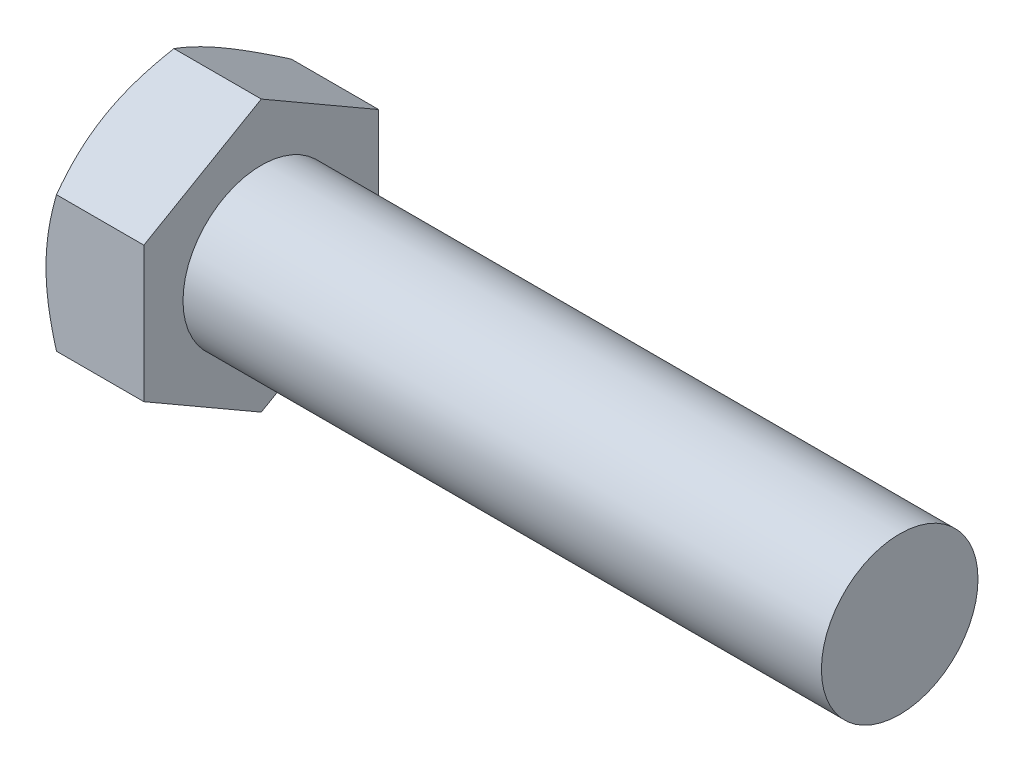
ISO-10303-21;
HEADER;
FILE_DESCRIPTION(('STEP AP214'),'2;1');
FILE_NAME('part.step','',(''),(''),'','','');
FILE_SCHEMA(('AUTOMOTIVE_DESIGN { 1 0 10303 214 1 1 1 1 }'));
ENDSEC;
DATA;
#1=APPLICATION_CONTEXT('core data for automotive mechanical design processes');
#2=APPLICATION_PROTOCOL_DEFINITION('international standard','automotive_design',2000,#1);
#3=PRODUCT_CONTEXT('',#1,'mechanical');
#4=PRODUCT('Part','Part','',(#3));
#5=PRODUCT_RELATED_PRODUCT_CATEGORY('part','',(#4));
#6=PRODUCT_DEFINITION_FORMATION('','',#4);
#7=PRODUCT_DEFINITION_CONTEXT('part definition',#1,'design');
#8=PRODUCT_DEFINITION('design','',#6,#7);
#9=PRODUCT_DEFINITION_SHAPE('','',#8);
#10=(LENGTH_UNIT() NAMED_UNIT(*) SI_UNIT(.MILLI.,.METRE.));
#11=(NAMED_UNIT(*) PLANE_ANGLE_UNIT() SI_UNIT($,.RADIAN.));
#12=(NAMED_UNIT(*) SI_UNIT($,.STERADIAN.) SOLID_ANGLE_UNIT());
#13=UNCERTAINTY_MEASURE_WITH_UNIT(LENGTH_MEASURE(1.E-05),#10,'distance_accuracy_value','');
#14=(GEOMETRIC_REPRESENTATION_CONTEXT(3) GLOBAL_UNCERTAINTY_ASSIGNED_CONTEXT((#13)) GLOBAL_UNIT_ASSIGNED_CONTEXT((#10,
#11,#12)) REPRESENTATION_CONTEXT('',''));
#15=CARTESIAN_POINT('',(0.,0.,0.));
#16=DIRECTION('',(0.,0.,1.));
#17=DIRECTION('',(1.,0.,0.));
#18=AXIS2_PLACEMENT_3D('',#15,#16,#17);
#19=CARTESIAN_POINT('',(61.,0.,0.));
#20=DIRECTION('',(-1.,0.,0.));
#21=DIRECTION('',(0.,0.,1.));
#22=AXIS2_PLACEMENT_3D('',#19,#20,#21);
#23=CYLINDRICAL_SURFACE('',#22,6.);
#24=CARTESIAN_POINT('',(0.,0.,0.));
#25=DIRECTION('',(-1.,0.,0.));
#26=DIRECTION('',(0.,0.,1.));
#27=AXIS2_PLACEMENT_3D('',#24,#25,#26);
#28=CIRCLE('',#27,6.);
#29=CARTESIAN_POINT('',(0.,0.,6.));
#30=VERTEX_POINT('',#29);
#31=EDGE_CURVE('E44',#30,#30,#28,.F.);
#32=ORIENTED_EDGE('',*,*,#31,.T.);
#33=EDGE_LOOP('',(#32));
#34=FACE_BOUND('',#33,.T.);
#35=CARTESIAN_POINT('',(48.9325515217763,0.,0.));
#36=DIRECTION('',(1.,0.,0.));
#37=DIRECTION('',(0.,0.,-1.));
#38=AXIS2_PLACEMENT_3D('',#35,#36,#37);
#39=CIRCLE('',#38,6.);
#40=CARTESIAN_POINT('',(48.9325515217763,0.,-6.));
#41=VERTEX_POINT('',#40);
#42=EDGE_CURVE('E11',#41,#41,#39,.T.);
#43=ORIENTED_EDGE('',*,*,#42,.F.);
#44=EDGE_LOOP('',(#43));
#45=FACE_BOUND('',#44,.T.);
#46=ADVANCED_FACE('F35',(#34,#45),#23,.T.);
#47=CARTESIAN_POINT('',(0.,15.5884572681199,9.));
#48=DIRECTION('',(-1.,0.,0.));
#49=DIRECTION('',(0.,0.,1.));
#50=AXIS2_PLACEMENT_3D('',#47,#48,#49);
#51=PLANE('',#50);
#52=DIRECTION('',(0.,-1.,0.));
#53=VECTOR('',#52,1.);
#54=CARTESIAN_POINT('',(0.,-5.19615242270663,9.));
#55=LINE('',#54,#53);
#56=CARTESIAN_POINT('',(0.,5.19615242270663,9.));
#57=VERTEX_POINT('',#56);
#58=CARTESIAN_POINT('',(0.,-5.19615242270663,9.));
#59=VERTEX_POINT('',#58);
#60=EDGE_CURVE('E230',#57,#59,#55,.T.);
#61=ORIENTED_EDGE('',*,*,#60,.T.);
#62=DIRECTION('',(0.,-0.5,-0.866025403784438));
#63=VECTOR('',#62,1.);
#64=CARTESIAN_POINT('',(0.,-10.3923048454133,0.));
#65=LINE('',#64,#63);
#66=CARTESIAN_POINT('',(0.,-10.3923048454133,0.));
#67=VERTEX_POINT('',#66);
#68=EDGE_CURVE('E233',#59,#67,#65,.T.);
#69=ORIENTED_EDGE('',*,*,#68,.T.);
#70=DIRECTION('',(0.,0.5,-0.866025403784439));
#71=VECTOR('',#70,1.);
#72=CARTESIAN_POINT('',(0.,-5.19615242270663,-9.));
#73=LINE('',#72,#71);
#74=CARTESIAN_POINT('',(0.,-5.19615242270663,-9.));
#75=VERTEX_POINT('',#74);
#76=EDGE_CURVE('E237',#67,#75,#73,.T.);
#77=ORIENTED_EDGE('',*,*,#76,.T.);
#78=DIRECTION('',(0.,1.,0.));
#79=VECTOR('',#78,1.);
#80=CARTESIAN_POINT('',(0.,5.19615242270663,-9.));
#81=LINE('',#80,#79);
#82=CARTESIAN_POINT('',(0.,5.19615242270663,-9.));
#83=VERTEX_POINT('',#82);
#84=EDGE_CURVE('E241',#75,#83,#81,.T.);
#85=ORIENTED_EDGE('',*,*,#84,.T.);
#86=DIRECTION('',(0.,0.5,0.866025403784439));
#87=VECTOR('',#86,1.);
#88=CARTESIAN_POINT('',(0.,10.3923048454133,0.));
#89=LINE('',#88,#87);
#90=CARTESIAN_POINT('',(0.,10.3923048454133,0.));
#91=VERTEX_POINT('',#90);
#92=EDGE_CURVE('E244',#83,#91,#89,.T.);
#93=ORIENTED_EDGE('',*,*,#92,.T.);
#94=DIRECTION('',(0.,-0.5,0.866025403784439));
#95=VECTOR('',#94,1.);
#96=CARTESIAN_POINT('',(0.,5.19615242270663,9.));
#97=LINE('',#96,#95);
#98=EDGE_CURVE('E235',#91,#57,#97,.T.);
#99=ORIENTED_EDGE('',*,*,#98,.T.);
#100=EDGE_LOOP('',(#61,#69,#77,#85,#93,#99));
#101=FACE_BOUND('',#100,.T.);
#102=ORIENTED_EDGE('',*,*,#31,.F.);
#103=EDGE_LOOP('',(#102));
#104=FACE_BOUND('',#103,.T.);
#105=ADVANCED_FACE('F170',(#101,#104),#51,.F.);
#106=CARTESIAN_POINT('',(-7.5,-5.19615242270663,9.));
#107=DIRECTION('',(0.,0.,1.));
#108=DIRECTION('',(0.,-1.,0.));
#109=AXIS2_PLACEMENT_3D('',#106,#107,#108);
#110=PLANE('',#109);
#111=DIRECTION('',(1.,0.,0.));
#112=VECTOR('',#111,1.);
#113=CARTESIAN_POINT('',(-7.5,5.19615242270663,9.));
#114=LINE('',#113,#112);
#115=CARTESIAN_POINT('',(-6.69615242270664,5.19615242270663,9.));
#116=VERTEX_POINT('',#115);
#117=EDGE_CURVE('E212',#116,#57,#114,.T.);
#118=ORIENTED_EDGE('',*,*,#117,.F.);
#119=CARTESIAN_POINT('',(-3.04439619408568,-14.0879095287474,9.));
#120=CARTESIAN_POINT('',(-3.23616569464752,-13.693655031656,9.));
#121=CARTESIAN_POINT('',(-3.42613358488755,-13.2985092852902,9.));
#122=CARTESIAN_POINT('',(-3.80145525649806,-12.5059616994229,9.));
#123=CARTESIAN_POINT('',(-3.98680833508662,-12.1085595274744,9.));
#124=CARTESIAN_POINT('',(-4.35279398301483,-11.3090404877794,9.));
#125=CARTESIAN_POINT('',(-4.53339647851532,-10.9069098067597,9.));
#126=CARTESIAN_POINT('',(-4.88738125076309,-10.0994948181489,9.));
#127=CARTESIAN_POINT('',(-5.06076386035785,-9.69421065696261,9.));
#128=CARTESIAN_POINT('',(-5.40398931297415,-8.86637898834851,9.));
#129=CARTESIAN_POINT('',(-5.57352564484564,-8.44370370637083,9.));
#130=CARTESIAN_POINT('',(-5.90008012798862,-7.59345787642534,9.));
#131=CARTESIAN_POINT('',(-6.05709689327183,-7.16588679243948,9.));
#132=CARTESIAN_POINT('',(-6.35458596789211,-6.30592235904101,9.));
#133=CARTESIAN_POINT('',(-6.4950906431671,-5.87354032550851,9.));
#134=CARTESIAN_POINT('',(-6.75513543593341,-5.0025908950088,9.));
#135=CARTESIAN_POINT('',(-6.87468201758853,-4.56402545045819,9.));
#136=CARTESIAN_POINT('',(-7.08652518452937,-3.68279147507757,9.));
#137=CARTESIAN_POINT('',(-7.17897094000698,-3.24015978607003,9.));
#138=CARTESIAN_POINT('',(-7.29336659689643,-2.5720797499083,9.));
#139=CARTESIAN_POINT('',(-7.32745445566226,-2.34868256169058,9.));
#140=CARTESIAN_POINT('',(-7.38687397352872,-1.90073399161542,9.));
#141=CARTESIAN_POINT('',(-7.41220648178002,-1.67618272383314,9.));
#142=CARTESIAN_POINT('',(-7.453285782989,-1.22921881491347,9.));
#143=CARTESIAN_POINT('',(-7.46915580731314,-1.00681754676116,9.));
#144=CARTESIAN_POINT('',(-7.49147045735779,-0.561542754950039,9.));
#145=CARTESIAN_POINT('',(-7.49791524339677,-0.338669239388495,9.));
#146=CARTESIAN_POINT('',(-7.50122518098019,0.107152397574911,9.));
#147=CARTESIAN_POINT('',(-7.49809026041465,0.330100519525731,9.));
#148=CARTESIAN_POINT('',(-7.48231893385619,0.775663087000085,9.));
#149=CARTESIAN_POINT('',(-7.4696820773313,0.998277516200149,9.));
#150=CARTESIAN_POINT('',(-7.42847699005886,1.52928538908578,9.));
#151=CARTESIAN_POINT('',(-7.39562319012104,1.83735365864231,9.));
#152=CARTESIAN_POINT('',(-7.31348089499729,2.45127496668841,9.));
#153=CARTESIAN_POINT('',(-7.26419028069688,2.75712771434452,9.));
#154=CARTESIAN_POINT('',(-7.09427111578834,3.6709642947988,9.));
#155=CARTESIAN_POINT('',(-6.95162294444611,4.27491194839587,9.));
#156=CARTESIAN_POINT('',(-6.70329904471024,5.17834875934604,9.));
#157=CARTESIAN_POINT('',(-6.613584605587,5.48249505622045,9.));
#158=CARTESIAN_POINT('',(-6.42460437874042,6.08783493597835,9.));
#159=CARTESIAN_POINT('',(-6.32533851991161,6.38902849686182,9.));
#160=CARTESIAN_POINT('',(-6.11886770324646,6.98855625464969,9.));
#161=CARTESIAN_POINT('',(-6.01166511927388,7.28689127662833,9.));
#162=CARTESIAN_POINT('',(-5.7906056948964,7.88107084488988,9.));
#163=CARTESIAN_POINT('',(-5.67674899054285,8.17691544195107,9.));
#164=CARTESIAN_POINT('',(-5.36908665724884,8.95441621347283,9.));
#165=CARTESIAN_POINT('',(-5.17061022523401,9.43422210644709,9.));
#166=CARTESIAN_POINT('',(-4.76247010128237,10.389068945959,9.));
#167=CARTESIAN_POINT('',(-4.55280529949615,10.864109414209,9.));
#168=CARTESIAN_POINT('',(-4.12486425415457,11.8104820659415,9.));
#169=CARTESIAN_POINT('',(-3.90658504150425,12.2818129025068,9.));
#170=CARTESIAN_POINT('',(-3.46341771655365,13.2213264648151,9.));
#171=CARTESIAN_POINT('',(-3.23852984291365,13.689509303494,9.));
#172=CARTESIAN_POINT('',(-2.78320833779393,14.6240308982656,9.));
#173=CARTESIAN_POINT('',(-2.55276692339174,15.0903658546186,9.));
#174=CARTESIAN_POINT('',(-2.08771687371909,16.020954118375,9.));
#175=CARTESIAN_POINT('',(-1.85310820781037,16.4852074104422,9.));
#176=CARTESIAN_POINT('',(-1.38057121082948,17.411902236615,9.));
#177=CARTESIAN_POINT('',(-1.14264355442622,17.8743441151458,9.));
#178=CARTESIAN_POINT('',(-0.66402956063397,18.7977988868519,9.));
#179=CARTESIAN_POINT('',(-0.423343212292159,19.2588117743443,9.));
#180=CARTESIAN_POINT('',(0.253008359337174,20.5465513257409,9.));
#181=CARTESIAN_POINT('',(0.691204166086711,21.3719486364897,8.99999999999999));
#182=CARTESIAN_POINT('',(1.57294903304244,23.0199314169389,8.99999999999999));
#183=CARTESIAN_POINT('',(2.01649839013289,23.8425167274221,8.99999999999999));
#184=CARTESIAN_POINT('',(2.9061980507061,25.4829119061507,8.99999999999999));
#185=CARTESIAN_POINT('',(3.35233568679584,26.3007286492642,8.99999999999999));
#186=CARTESIAN_POINT('',(4.02382689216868,27.5261617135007,8.99999999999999));
#187=CARTESIAN_POINT('',(4.24802994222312,27.9344093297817,8.99999999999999));
#188=CARTESIAN_POINT('',(4.69711875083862,28.7505282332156,8.99999999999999));
#189=CARTESIAN_POINT('',(4.92200450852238,29.1583995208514,9.));
#190=CARTESIAN_POINT('',(5.1471898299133,29.5661053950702,9.));
#191=B_SPLINE_CURVE_WITH_KNOTS('',3,(#119,#120,#121,#122,#123,#124,#125,#126,#127,#128,#129,
#130,#131,#132,#133,#134,#135,#136,#137,#138,#139,#140,#141,#142,#143,#144,#145,#146,#147,#148,
#149,#150,#151,#152,#153,#154,#155,#156,#157,#158,#159,#160,#161,#162,#163,#164,#165,#166,#167,
#168,#169,#170,#171,#172,#173,#174,#175,#176,#177,#178,#179,#180,#181,#182,#183,#184,#185,#186,
#187,#188,#189,#190),.UNSPECIFIED.,.F.,.F.,(4,2,2,2,2,2,2,2,2,2,2,2,2,2,2,2,2,2,2,2,2,2,2,2,2,2,
2,2,2,2,2,2,2,2,2,4),(0.,1.31527562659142,2.63075034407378,3.95316726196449,5.27552314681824,
6.64159484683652,8.0078175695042,9.37131599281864,10.7343931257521,12.0898202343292,
12.7676245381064,13.445363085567,14.1140707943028,14.7827671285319,15.4514684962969,
16.1202015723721,17.0491251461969,17.9781685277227,19.8371982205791,20.7884210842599,
21.7396510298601,22.6905976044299,23.6415247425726,25.1990257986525,26.7566816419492,
28.3148791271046,29.8730204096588,31.4334894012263,32.993969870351,34.5541376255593,
36.1143115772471,38.9177907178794,41.7214260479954,44.5161918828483,45.9134738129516,
47.3107539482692),.UNSPECIFIED.);
#192=CARTESIAN_POINT('',(-7.5,0.,9.));
#193=VERTEX_POINT('',#192);
#194=EDGE_CURVE('E110',#116,#193,#191,.F.);
#195=ORIENTED_EDGE('',*,*,#194,.T.);
#196=CARTESIAN_POINT('',(-6.69615242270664,-5.19615242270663,9.));
#197=VERTEX_POINT('',#196);
#198=EDGE_CURVE('E185',#193,#197,#191,.F.);
#199=ORIENTED_EDGE('',*,*,#198,.T.);
#200=DIRECTION('',(1.,0.,0.));
#201=VECTOR('',#200,1.);
#202=CARTESIAN_POINT('',(-7.5,-5.19615242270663,9.));
#203=LINE('',#202,#201);
#204=EDGE_CURVE('E213',#197,#59,#203,.T.);
#205=ORIENTED_EDGE('',*,*,#204,.T.);
#206=ORIENTED_EDGE('',*,*,#60,.F.);
#207=EDGE_LOOP('',(#118,#195,#199,#205,#206));
#208=FACE_BOUND('',#207,.T.);
#209=ADVANCED_FACE('F37',(#208),#110,.T.);
#210=CARTESIAN_POINT('',(-7.5,5.19615242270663,9.));
#211=DIRECTION('',(0.,0.866025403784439,0.5));
#212=DIRECTION('',(0.,-0.5,0.866025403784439));
#213=AXIS2_PLACEMENT_3D('',#210,#211,#212);
#214=PLANE('',#213);
#215=DIRECTION('',(1.,0.,0.));
#216=VECTOR('',#215,1.);
#217=CARTESIAN_POINT('',(-7.5,10.3923048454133,0.));
#218=LINE('',#217,#216);
#219=CARTESIAN_POINT('',(-6.69615242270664,10.3923048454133,0.));
#220=VERTEX_POINT('',#219);
#221=EDGE_CURVE('E139',#220,#91,#218,.T.);
#222=ORIENTED_EDGE('',*,*,#221,.F.);
#223=CARTESIAN_POINT('',(-6.69608575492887,10.3924203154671,-0.000199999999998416));
#224=CARTESIAN_POINT('',(-6.76201799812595,10.2782163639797,0.197607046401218));
#225=CARTESIAN_POINT('',(-6.82495859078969,10.1635669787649,0.396185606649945));
#226=CARTESIAN_POINT('',(-6.94403100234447,9.9333371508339,0.794955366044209));
#227=CARTESIAN_POINT('',(-7.00015988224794,9.81775632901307,0.99514722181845));
#228=CARTESIAN_POINT('',(-7.10484803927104,9.58544915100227,1.3975150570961));
#229=CARTESIAN_POINT('',(-7.15338922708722,9.46872074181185,1.5996945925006));
#230=CARTESIAN_POINT('',(-7.24185148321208,9.23447001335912,2.00542875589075));
#231=CARTESIAN_POINT('',(-7.28177431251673,9.11694786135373,2.20898309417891));
#232=CARTESIAN_POINT('',(-7.35131532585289,8.88408932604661,2.61230590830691));
#233=CARTESIAN_POINT('',(-7.3811624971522,8.76877014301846,2.812044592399));
#234=CARTESIAN_POINT('',(-7.43120669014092,8.53761579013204,3.21241567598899));
#235=CARTESIAN_POINT('',(-7.45140456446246,8.42178066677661,3.4130479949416));
#236=CARTESIAN_POINT('',(-7.48164565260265,8.18990950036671,3.81466063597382));
#237=CARTESIAN_POINT('',(-7.4917003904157,8.07387383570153,4.01564030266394));
#238=CARTESIAN_POINT('',(-7.50143766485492,7.84169571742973,4.41778459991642));
#239=CARTESIAN_POINT('',(-7.50112052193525,7.72555326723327,4.61894922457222));
#240=CARTESIAN_POINT('',(-7.49083604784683,7.50842142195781,4.9950326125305));
#241=CARTESIAN_POINT('',(-7.48212325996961,7.40741671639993,5.16997789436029));
#242=CARTESIAN_POINT('',(-7.45702265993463,7.20564389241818,5.51945867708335));
#243=CARTESIAN_POINT('',(-7.44063433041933,7.10487579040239,5.69399414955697));
#244=CARTESIAN_POINT('',(-7.38034344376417,6.80296159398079,6.2169248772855));
#245=CARTESIAN_POINT('',(-7.32532251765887,6.60234990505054,6.56439451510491));
#246=CARTESIAN_POINT('',(-7.18776952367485,6.1989985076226,7.263019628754));
#247=CARTESIAN_POINT('',(-7.10465438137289,5.99631027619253,7.61408594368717));
#248=CARTESIAN_POINT('',(-6.91601746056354,5.59395639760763,8.3109833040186));
#249=CARTESIAN_POINT('',(-6.81053998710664,5.39428559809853,8.65682327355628));
#250=CARTESIAN_POINT('',(-6.69608575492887,5.19603695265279,9.0002));
#251=B_SPLINE_CURVE_WITH_KNOTS('',3,(#223,#224,#225,#226,#227,#228,#229,#230,#231,#232,#233,
#234,#235,#236,#237,#238,#239,#240,#241,#242,#243,#244,#245,#246,#247,#248,#249,#250),
.UNSPECIFIED.,.F.,.F.,(4,2,2,2,2,2,2,2,2,2,2,2,2,4),(0.,0.713219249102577,1.42674513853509,
2.14194697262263,2.8570025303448,3.55449749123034,4.25193080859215,4.94857085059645,
5.64518936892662,6.25162976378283,6.8581110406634,8.07193747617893,9.31268391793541,
10.5509947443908),.UNSPECIFIED.);
#252=CARTESIAN_POINT('',(-7.5,7.79422863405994,4.5));
#253=VERTEX_POINT('',#252);
#254=EDGE_CURVE('E114',#220,#253,#251,.T.);
#255=ORIENTED_EDGE('',*,*,#254,.T.);
#256=EDGE_CURVE('E106',#253,#116,#251,.T.);
#257=ORIENTED_EDGE('',*,*,#256,.T.);
#258=ORIENTED_EDGE('',*,*,#117,.T.);
#259=ORIENTED_EDGE('',*,*,#98,.F.);
#260=EDGE_LOOP('',(#222,#255,#257,#258,#259));
#261=FACE_BOUND('',#260,.T.);
#262=ADVANCED_FACE('F137',(#261),#214,.T.);
#263=CARTESIAN_POINT('',(-7.5,10.3923048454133,0.));
#264=DIRECTION('',(0.,0.866025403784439,-0.5));
#265=DIRECTION('',(0.,0.5,0.866025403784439));
#266=AXIS2_PLACEMENT_3D('',#263,#264,#265);
#267=PLANE('',#266);
#268=DIRECTION('',(1.,0.,0.));
#269=VECTOR('',#268,1.);
#270=CARTESIAN_POINT('',(-7.5,5.19615242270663,-9.));
#271=LINE('',#270,#269);
#272=CARTESIAN_POINT('',(-6.69615242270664,5.19615242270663,-9.));
#273=VERTEX_POINT('',#272);
#274=EDGE_CURVE('E249',#273,#83,#271,.T.);
#275=ORIENTED_EDGE('',*,*,#274,.F.);
#276=CARTESIAN_POINT('',(-6.69608575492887,5.19603695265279,-9.0002));
#277=CARTESIAN_POINT('',(-6.76201799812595,5.31024090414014,-8.80239295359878));
#278=CARTESIAN_POINT('',(-6.82495859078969,5.42489028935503,-8.60381439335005));
#279=CARTESIAN_POINT('',(-6.94403100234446,5.65512011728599,-8.20504463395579));
#280=CARTESIAN_POINT('',(-7.00015988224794,5.77070093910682,-8.00485277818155));
#281=CARTESIAN_POINT('',(-7.10484803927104,6.00300811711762,-7.6024849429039));
#282=CARTESIAN_POINT('',(-7.15338922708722,6.11973652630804,-7.4003054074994));
#283=CARTESIAN_POINT('',(-7.24185148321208,6.35398725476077,-6.99457124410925));
#284=CARTESIAN_POINT('',(-7.28177431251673,6.47150940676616,-6.79101690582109));
#285=CARTESIAN_POINT('',(-7.35131532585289,6.70436794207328,-6.38769409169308));
#286=CARTESIAN_POINT('',(-7.3811624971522,6.81968712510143,-6.18795540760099));
#287=CARTESIAN_POINT('',(-7.43120669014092,7.05084147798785,-5.787584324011));
#288=CARTESIAN_POINT('',(-7.45140456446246,7.16667660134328,-5.58695200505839));
#289=CARTESIAN_POINT('',(-7.48164565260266,7.39854776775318,-5.18533936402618));
#290=CARTESIAN_POINT('',(-7.4917003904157,7.51458343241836,-4.98435969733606));
#291=CARTESIAN_POINT('',(-7.50143766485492,7.74676155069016,-4.58221540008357));
#292=CARTESIAN_POINT('',(-7.50112052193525,7.86290400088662,-4.38105077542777));
#293=CARTESIAN_POINT('',(-7.49083604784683,8.08003584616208,-4.00496738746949));
#294=CARTESIAN_POINT('',(-7.48212325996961,8.18104055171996,-3.8300221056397));
#295=CARTESIAN_POINT('',(-7.45702265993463,8.38281337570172,-3.48054132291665));
#296=CARTESIAN_POINT('',(-7.44063433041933,8.4835814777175,-3.30600585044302));
#297=CARTESIAN_POINT('',(-7.38034344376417,8.7854956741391,-2.78307512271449));
#298=CARTESIAN_POINT('',(-7.32532251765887,8.98610736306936,-2.43560548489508));
#299=CARTESIAN_POINT('',(-7.18776952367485,9.38945876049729,-1.73698037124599));
#300=CARTESIAN_POINT('',(-7.10465438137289,9.59214699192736,-1.38591405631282));
#301=CARTESIAN_POINT('',(-6.91601746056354,9.99450087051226,-0.689016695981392));
#302=CARTESIAN_POINT('',(-6.81053998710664,10.1941716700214,-0.343176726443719));
#303=CARTESIAN_POINT('',(-6.69608575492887,10.3924203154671,0.000200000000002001));
#304=B_SPLINE_CURVE_WITH_KNOTS('',3,(#276,#277,#278,#279,#280,#281,#282,#283,#284,#285,#286,
#287,#288,#289,#290,#291,#292,#293,#294,#295,#296,#297,#298,#299,#300,#301,#302,#303),
.UNSPECIFIED.,.F.,.F.,(4,2,2,2,2,2,2,2,2,2,2,2,2,4),(0.,0.713219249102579,1.42674513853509,
2.14194697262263,2.85700253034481,3.55449749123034,4.25193080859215,4.94857085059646,
5.64518936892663,6.25162976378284,6.85811104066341,8.07193747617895,9.31268391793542,
10.5509947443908),.UNSPECIFIED.);
#305=CARTESIAN_POINT('',(-7.5,7.79422863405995,-4.5));
#306=VERTEX_POINT('',#305);
#307=EDGE_CURVE('E236',#273,#306,#304,.T.);
#308=ORIENTED_EDGE('',*,*,#307,.T.);
#309=EDGE_CURVE('E122',#306,#220,#304,.T.);
#310=ORIENTED_EDGE('',*,*,#309,.T.);
#311=ORIENTED_EDGE('',*,*,#221,.T.);
#312=ORIENTED_EDGE('',*,*,#92,.F.);
#313=EDGE_LOOP('',(#275,#308,#310,#311,#312));
#314=FACE_BOUND('',#313,.T.);
#315=ADVANCED_FACE('F266',(#314),#267,.T.);
#316=CARTESIAN_POINT('',(-7.5,5.19615242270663,-9.));
#317=DIRECTION('',(0.,0.,-1.));
#318=DIRECTION('',(-1.,0.,0.));
#319=AXIS2_PLACEMENT_3D('',#316,#317,#318);
#320=PLANE('',#319);
#321=DIRECTION('',(1.,0.,0.));
#322=VECTOR('',#321,1.);
#323=CARTESIAN_POINT('',(-7.5,-5.19615242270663,-9.));
#324=LINE('',#323,#322);
#325=CARTESIAN_POINT('',(-6.69615242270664,-5.19615242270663,-9.));
#326=VERTEX_POINT('',#325);
#327=EDGE_CURVE('E204',#326,#75,#324,.T.);
#328=ORIENTED_EDGE('',*,*,#327,.F.);
#329=CARTESIAN_POINT('',(-3.04439619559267,-14.08790952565,-9.));
#330=CARTESIAN_POINT('',(-3.2361656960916,-13.6936550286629,-9.));
#331=CARTESIAN_POINT('',(-3.42613358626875,-13.2985092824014,-9.));
#332=CARTESIAN_POINT('',(-3.80145525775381,-12.505961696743,-9.));
#333=CARTESIAN_POINT('',(-3.98680833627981,-12.1085595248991,-9.));
#334=CARTESIAN_POINT('',(-4.35279398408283,-11.309040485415,-9.));
#335=CARTESIAN_POINT('',(-4.53339647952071,-10.9069098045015,-9.));
#336=CARTESIAN_POINT('',(-4.88738125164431,-10.0994948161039,-9.));
#337=CARTESIAN_POINT('',(-5.06076386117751,-9.69421065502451,-9.));
#338=CARTESIAN_POINT('',(-5.40398931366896,-8.86637898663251,-9.));
#339=CARTESIAN_POINT('',(-5.57352564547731,-8.44370370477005,-9.));
#340=CARTESIAN_POINT('',(-5.90008012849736,-7.59345787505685,-9.));
#341=CARTESIAN_POINT('',(-6.05709689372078,-7.16588679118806,-9.));
#342=CARTESIAN_POINT('',(-6.35458596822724,-6.30592235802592,-9.));
#343=CARTESIAN_POINT('',(-6.49509064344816,-5.87354032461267,-9.));
#344=CARTESIAN_POINT('',(-6.75513543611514,-5.00259089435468,-9.));
#345=CARTESIAN_POINT('',(-6.87468201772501,-4.56402544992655,-9.));
#346=CARTESIAN_POINT('',(-7.08652518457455,-3.68279147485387,-9.));
#347=CARTESIAN_POINT('',(-7.17897094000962,-3.24015978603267,-9.));
#348=CARTESIAN_POINT('',(-7.29336659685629,-2.57207975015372,-9.));
#349=CARTESIAN_POINT('',(-7.32745445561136,-2.34868256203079,-9.));
#350=CARTESIAN_POINT('',(-7.38687397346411,-1.90073399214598,-9.));
#351=CARTESIAN_POINT('',(-7.41220648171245,-1.67618272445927,-9.));
#352=CARTESIAN_POINT('',(-7.45328578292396,-1.22921881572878,-9.));
#353=CARTESIAN_POINT('',(-7.46915580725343,-1.00681754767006,-9.));
#354=CARTESIAN_POINT('',(-7.49147045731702,-0.561542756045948,-9.));
#355=CARTESIAN_POINT('',(-7.4979152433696,-0.338669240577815,-9.));
#356=CARTESIAN_POINT('',(-7.50122518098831,0.107152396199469,-9.));
#357=CARTESIAN_POINT('',(-7.49809026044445,0.330100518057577,-9.));
#358=CARTESIAN_POINT('',(-7.48231893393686,0.775663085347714,-9.));
#359=CARTESIAN_POINT('',(-7.46968207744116,0.998277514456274,-9.));
#360=CARTESIAN_POINT('',(-7.42847699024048,1.52928538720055,-9.));
#361=CARTESIAN_POINT('',(-7.39562319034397,1.83735365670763,-9.));
#362=CARTESIAN_POINT('',(-7.31348089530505,2.45127496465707,-9.));
#363=CARTESIAN_POINT('',(-7.26419028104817,2.75712771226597,-9.));
#364=CARTESIAN_POINT('',(-7.09427111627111,3.67096429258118,-9.));
#365=CARTESIAN_POINT('',(-6.95162294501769,4.27491194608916,-9.));
#366=CARTESIAN_POINT('',(-6.70329904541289,5.17834875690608,-9.));
#367=CARTESIAN_POINT('',(-6.61358460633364,5.48249505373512,-9.));
#368=CARTESIAN_POINT('',(-6.42460437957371,6.08783493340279,-9.));
#369=CARTESIAN_POINT('',(-6.32533852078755,6.38902849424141,-9.));
#370=CARTESIAN_POINT('',(-6.11886770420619,6.98855625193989,-9.));
#371=CARTESIAN_POINT('',(-6.01166512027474,7.28689127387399,-9.));
#372=CARTESIAN_POINT('',(-5.79060569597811,7.88107084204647,-9.));
#373=CARTESIAN_POINT('',(-5.67674899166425,8.17691543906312,-9.));
#374=CARTESIAN_POINT('',(-5.36908665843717,8.95441621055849,-9.));
#375=CARTESIAN_POINT('',(-5.17061022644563,9.43422210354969,-9.));
#376=CARTESIAN_POINT('',(-4.76247010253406,10.3890689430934,-9.));
#377=CARTESIAN_POINT('',(-4.55280530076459,10.8641094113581,-9.));
#378=CARTESIAN_POINT('',(-4.12486425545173,11.8104820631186,-9.));
#379=CARTESIAN_POINT('',(-3.90658504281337,12.2818128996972,-9.));
#380=CARTESIAN_POINT('',(-3.46341771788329,13.2213264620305,-9.));
#381=CARTESIAN_POINT('',(-3.23852984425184,13.6895093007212,-9.));
#382=CARTESIAN_POINT('',(-2.78320833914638,14.624030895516,-9.));
#383=CARTESIAN_POINT('',(-2.55276692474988,15.0903658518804,-9.));
#384=CARTESIAN_POINT('',(-2.08771687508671,16.0209541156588,-9.));
#385=CARTESIAN_POINT('',(-1.85310820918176,16.4852074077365,-9.));
#386=CARTESIAN_POINT('',(-1.38057121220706,17.4119022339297,-9.));
#387=CARTESIAN_POINT('',(-1.14264355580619,17.8743441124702,-9.));
#388=CARTESIAN_POINT('',(-0.664029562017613,18.7977988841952,-9.));
#389=CARTESIAN_POINT('',(-0.423343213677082,19.2588117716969,-9.));
#390=CARTESIAN_POINT('',(0.253008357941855,20.5465513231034,-9.));
#391=CARTESIAN_POINT('',(0.6912041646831,21.3719486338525,-9.));
#392=CARTESIAN_POINT('',(1.57294903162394,23.0199314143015,-9.));
#393=CARTESIAN_POINT('',(2.01649838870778,23.8425167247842,-9.));
#394=CARTESIAN_POINT('',(2.90619804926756,25.4829119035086,-9.));
#395=CARTESIAN_POINT('',(3.35233568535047,26.3007286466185,-9.));
#396=CARTESIAN_POINT('',(4.02382689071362,27.5261617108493,-9.));
#397=CARTESIAN_POINT('',(4.24802994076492,27.9344093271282,-9.));
#398=CARTESIAN_POINT('',(4.69711874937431,28.7505282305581,-9.));
#399=CARTESIAN_POINT('',(4.9220045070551,29.1583995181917,-9.));
#400=CARTESIAN_POINT('',(5.14718982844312,29.5661053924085,-9.));
#401=B_SPLINE_CURVE_WITH_KNOTS('',3,(#329,#330,#331,#332,#333,#334,#335,#336,#337,#338,#339,
#340,#341,#342,#343,#344,#345,#346,#347,#348,#349,#350,#351,#352,#353,#354,#355,#356,#357,#358,
#359,#360,#361,#362,#363,#364,#365,#366,#367,#368,#369,#370,#371,#372,#373,#374,#375,#376,#377,
#378,#379,#380,#381,#382,#383,#384,#385,#386,#387,#388,#389,#390,#391,#392,#393,#394,#395,#396,
#397,#398,#399,#400),.UNSPECIFIED.,.F.,.F.,(4,2,2,2,2,2,2,2,2,2,2,2,2,2,2,2,2,2,2,2,2,2,2,2,2,2,
2,2,2,2,2,2,2,2,2,4),(0.,1.31527562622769,2.63075034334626,3.95316726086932,5.27552314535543,
6.64159484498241,8.00781756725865,9.37131599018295,10.7343931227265,12.0898202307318,
12.7676245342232,13.4453630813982,14.1140707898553,14.7827671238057,15.4514684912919,
16.1202015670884,17.0491251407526,17.9781685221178,19.8371982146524,20.7884210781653,
21.7396510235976,22.6905975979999,23.6415247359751,25.1990257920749,26.7566816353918,
28.3148791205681,29.8730204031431,31.4334893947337,32.9939698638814,34.5541376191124,
36.114311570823,38.9177907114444,41.7214260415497,44.5161918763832,45.9134738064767,
47.3107539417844),.UNSPECIFIED.);
#402=CARTESIAN_POINT('',(-7.5,0.,-9.));
#403=VERTEX_POINT('',#402);
#404=EDGE_CURVE('E115',#326,#403,#401,.T.);
#405=ORIENTED_EDGE('',*,*,#404,.T.);
#406=EDGE_CURVE('E140',#403,#273,#401,.T.);
#407=ORIENTED_EDGE('',*,*,#406,.T.);
#408=ORIENTED_EDGE('',*,*,#274,.T.);
#409=ORIENTED_EDGE('',*,*,#84,.F.);
#410=EDGE_LOOP('',(#328,#405,#407,#408,#409));
#411=FACE_BOUND('',#410,.T.);
#412=ADVANCED_FACE('F201',(#411),#320,.T.);
#413=CARTESIAN_POINT('',(-7.5,-5.19615242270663,-9.));
#414=DIRECTION('',(0.,-0.866025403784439,-0.5));
#415=DIRECTION('',(0.,0.5,-0.866025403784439));
#416=AXIS2_PLACEMENT_3D('',#413,#414,#415);
#417=PLANE('',#416);
#418=DIRECTION('',(1.,0.,0.));
#419=VECTOR('',#418,1.);
#420=CARTESIAN_POINT('',(-7.5,-10.3923048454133,0.));
#421=LINE('',#420,#419);
#422=CARTESIAN_POINT('',(-6.69615242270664,-10.3923048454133,0.));
#423=VERTEX_POINT('',#422);
#424=EDGE_CURVE('E251',#423,#67,#421,.T.);
#425=ORIENTED_EDGE('',*,*,#424,.F.);
#426=CARTESIAN_POINT('',(-6.69608575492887,-10.3924203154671,0.000200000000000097));
#427=CARTESIAN_POINT('',(-6.76201799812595,-10.2782163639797,-0.197607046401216));
#428=CARTESIAN_POINT('',(-6.82495859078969,-10.1635669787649,-0.396185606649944));
#429=CARTESIAN_POINT('',(-6.94403100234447,-9.9333371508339,-0.79495536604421));
#430=CARTESIAN_POINT('',(-7.00015988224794,-9.81775632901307,-0.995147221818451));
#431=CARTESIAN_POINT('',(-7.10484803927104,-9.58544915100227,-1.3975150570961));
#432=CARTESIAN_POINT('',(-7.15338922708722,-9.46872074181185,-1.5996945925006));
#433=CARTESIAN_POINT('',(-7.24185148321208,-9.23447001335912,-2.00542875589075));
#434=CARTESIAN_POINT('',(-7.28177431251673,-9.11694786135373,-2.20898309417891));
#435=CARTESIAN_POINT('',(-7.35131532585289,-8.88408932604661,-2.61230590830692));
#436=CARTESIAN_POINT('',(-7.3811624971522,-8.76877014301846,-2.81204459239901));
#437=CARTESIAN_POINT('',(-7.43120669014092,-8.53761579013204,-3.212415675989));
#438=CARTESIAN_POINT('',(-7.45140456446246,-8.42178066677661,-3.41304799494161));
#439=CARTESIAN_POINT('',(-7.48164565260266,-8.1899095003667,-3.81466063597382));
#440=CARTESIAN_POINT('',(-7.4917003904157,-8.07387383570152,-4.01564030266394));
#441=CARTESIAN_POINT('',(-7.50143766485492,-7.84169571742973,-4.41778459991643));
#442=CARTESIAN_POINT('',(-7.50112052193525,-7.72555326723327,-4.61894922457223));
#443=CARTESIAN_POINT('',(-7.49083604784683,-7.50842142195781,-4.99503261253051));
#444=CARTESIAN_POINT('',(-7.4821232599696,-7.40741671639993,-5.16997789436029));
#445=CARTESIAN_POINT('',(-7.45702265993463,-7.20564389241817,-5.51945867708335));
#446=CARTESIAN_POINT('',(-7.44063433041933,-7.10487579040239,-5.69399414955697));
#447=CARTESIAN_POINT('',(-7.38034344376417,-6.80296159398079,-6.21692487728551));
#448=CARTESIAN_POINT('',(-7.32532251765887,-6.60234990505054,-6.56439451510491));
#449=CARTESIAN_POINT('',(-7.18776952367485,-6.1989985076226,-7.263019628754));
#450=CARTESIAN_POINT('',(-7.10465438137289,-5.99631027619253,-7.61408594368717));
#451=CARTESIAN_POINT('',(-6.91601746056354,-5.59395639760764,-8.3109833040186));
#452=CARTESIAN_POINT('',(-6.81053998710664,-5.39428559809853,-8.65682327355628));
#453=CARTESIAN_POINT('',(-6.69608575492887,-5.1960369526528,-9.0002));
#454=B_SPLINE_CURVE_WITH_KNOTS('',3,(#426,#427,#428,#429,#430,#431,#432,#433,#434,#435,#436,
#437,#438,#439,#440,#441,#442,#443,#444,#445,#446,#447,#448,#449,#450,#451,#452,#453),
.UNSPECIFIED.,.F.,.F.,(4,2,2,2,2,2,2,2,2,2,2,2,2,4),(0.,0.713219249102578,1.42674513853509,
2.14194697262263,2.85700253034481,3.55449749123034,4.25193080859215,4.94857085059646,
5.64518936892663,6.25162976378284,6.85811104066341,8.07193747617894,9.31268391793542,
10.5509947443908),.UNSPECIFIED.);
#455=CARTESIAN_POINT('',(-7.5,-7.79422863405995,-4.5));
#456=VERTEX_POINT('',#455);
#457=EDGE_CURVE('E59',#423,#456,#454,.T.);
#458=ORIENTED_EDGE('',*,*,#457,.T.);
#459=EDGE_CURVE('E192',#456,#326,#454,.T.);
#460=ORIENTED_EDGE('',*,*,#459,.T.);
#461=ORIENTED_EDGE('',*,*,#327,.T.);
#462=ORIENTED_EDGE('',*,*,#76,.F.);
#463=EDGE_LOOP('',(#425,#458,#460,#461,#462));
#464=FACE_BOUND('',#463,.T.);
#465=ADVANCED_FACE('F256',(#464),#417,.T.);
#466=CARTESIAN_POINT('',(-7.5,-10.3923048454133,0.));
#467=DIRECTION('',(0.,-0.866025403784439,0.5));
#468=DIRECTION('',(0.,-0.5,-0.866025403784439));
#469=AXIS2_PLACEMENT_3D('',#466,#467,#468);
#470=PLANE('',#469);
#471=ORIENTED_EDGE('',*,*,#204,.F.);
#472=CARTESIAN_POINT('',(-6.69608575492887,-5.19603695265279,9.0002));
#473=CARTESIAN_POINT('',(-6.76201799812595,-5.31024090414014,8.80239295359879));
#474=CARTESIAN_POINT('',(-6.82495859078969,-5.42489028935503,8.60381439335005));
#475=CARTESIAN_POINT('',(-6.94403100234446,-5.65512011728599,8.20504463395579));
#476=CARTESIAN_POINT('',(-7.00015988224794,-5.77070093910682,8.00485277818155));
#477=CARTESIAN_POINT('',(-7.10484803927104,-6.00300811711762,7.6024849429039));
#478=CARTESIAN_POINT('',(-7.15338922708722,-6.11973652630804,7.4003054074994));
#479=CARTESIAN_POINT('',(-7.24185148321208,-6.35398725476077,6.99457124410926));
#480=CARTESIAN_POINT('',(-7.28177431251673,-6.47150940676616,6.79101690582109));
#481=CARTESIAN_POINT('',(-7.35131532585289,-6.70436794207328,6.38769409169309));
#482=CARTESIAN_POINT('',(-7.3811624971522,-6.81968712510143,6.187955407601));
#483=CARTESIAN_POINT('',(-7.43120669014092,-7.05084147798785,5.787584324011));
#484=CARTESIAN_POINT('',(-7.45140456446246,-7.16667660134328,5.58695200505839));
#485=CARTESIAN_POINT('',(-7.48164565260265,-7.39854776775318,5.18533936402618));
#486=CARTESIAN_POINT('',(-7.4917003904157,-7.51458343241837,4.98435969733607));
#487=CARTESIAN_POINT('',(-7.50143766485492,-7.74676155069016,4.58221540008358));
#488=CARTESIAN_POINT('',(-7.50112052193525,-7.86290400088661,4.38105077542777));
#489=CARTESIAN_POINT('',(-7.49083604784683,-8.08003584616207,4.00496738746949));
#490=CARTESIAN_POINT('',(-7.48212325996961,-8.18104055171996,3.83002210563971));
#491=CARTESIAN_POINT('',(-7.45702265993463,-8.38281337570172,3.48054132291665));
#492=CARTESIAN_POINT('',(-7.44063433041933,-8.4835814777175,3.30600585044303));
#493=CARTESIAN_POINT('',(-7.38034344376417,-8.7854956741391,2.78307512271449));
#494=CARTESIAN_POINT('',(-7.32532251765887,-8.98610736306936,2.43560548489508));
#495=CARTESIAN_POINT('',(-7.18776952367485,-9.38945876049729,1.736980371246));
#496=CARTESIAN_POINT('',(-7.10465438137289,-9.59214699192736,1.38591405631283));
#497=CARTESIAN_POINT('',(-6.91601746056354,-9.99450087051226,0.689016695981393));
#498=CARTESIAN_POINT('',(-6.81053998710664,-10.1941716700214,0.34317672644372));
#499=CARTESIAN_POINT('',(-6.69608575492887,-10.3924203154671,-0.000200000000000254));
#500=B_SPLINE_CURVE_WITH_KNOTS('',3,(#472,#473,#474,#475,#476,#477,#478,#479,#480,#481,#482,
#483,#484,#485,#486,#487,#488,#489,#490,#491,#492,#493,#494,#495,#496,#497,#498,#499),
.UNSPECIFIED.,.F.,.F.,(4,2,2,2,2,2,2,2,2,2,2,2,2,4),(0.,0.713219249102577,1.42674513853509,
2.14194697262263,2.85700253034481,3.55449749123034,4.25193080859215,4.94857085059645,
5.64518936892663,6.25162976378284,6.85811104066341,8.07193747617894,9.31268391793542,
10.5509947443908),.UNSPECIFIED.);
#501=CARTESIAN_POINT('',(-7.5,-7.79422863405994,4.5));
#502=VERTEX_POINT('',#501);
#503=EDGE_CURVE('E193',#197,#502,#500,.T.);
#504=ORIENTED_EDGE('',*,*,#503,.T.);
#505=EDGE_CURVE('E134',#502,#423,#500,.T.);
#506=ORIENTED_EDGE('',*,*,#505,.T.);
#507=ORIENTED_EDGE('',*,*,#424,.T.);
#508=ORIENTED_EDGE('',*,*,#68,.F.);
#509=EDGE_LOOP('',(#471,#504,#506,#507,#508));
#510=FACE_BOUND('',#509,.T.);
#511=ADVANCED_FACE('F254',(#510),#470,.T.);
#512=CARTESIAN_POINT('',(-7.5,0.,0.));
#513=DIRECTION('',(1.,0.,0.));
#514=DIRECTION('',(0.,0.,1.));
#515=AXIS2_PLACEMENT_3D('',#512,#513,#514);
#516=CONICAL_SURFACE('',#515,9.,1.0471975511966);
#517=CARTESIAN_POINT('',(-7.5,0.,0.));
#518=DIRECTION('',(-1.,0.,0.));
#519=DIRECTION('',(0.,0.,1.));
#520=AXIS2_PLACEMENT_3D('',#517,#518,#519);
#521=CIRCLE('',#520,9.);
#522=EDGE_CURVE('E129',#502,#193,#521,.T.);
#523=ORIENTED_EDGE('',*,*,#522,.F.);
#524=ORIENTED_EDGE('',*,*,#503,.F.);
#525=ORIENTED_EDGE('',*,*,#198,.F.);
#526=EDGE_LOOP('',(#523,#524,#525));
#527=FACE_BOUND('',#526,.T.);
#528=ADVANCED_FACE('F167',(#527),#516,.T.);
#529=ORIENTED_EDGE('',*,*,#505,.F.);
#530=EDGE_CURVE('E209',#456,#502,#521,.T.);
#531=ORIENTED_EDGE('',*,*,#530,.F.);
#532=ORIENTED_EDGE('',*,*,#457,.F.);
#533=EDGE_LOOP('',(#529,#531,#532));
#534=FACE_BOUND('',#533,.T.);
#535=ADVANCED_FACE('F161',(#534),#516,.T.);
#536=ORIENTED_EDGE('',*,*,#459,.F.);
#537=EDGE_CURVE('E208',#403,#456,#521,.T.);
#538=ORIENTED_EDGE('',*,*,#537,.F.);
#539=ORIENTED_EDGE('',*,*,#404,.F.);
#540=EDGE_LOOP('',(#536,#538,#539));
#541=FACE_BOUND('',#540,.T.);
#542=ADVANCED_FACE('F166',(#541),#516,.T.);
#543=ORIENTED_EDGE('',*,*,#406,.F.);
#544=EDGE_CURVE('E127',#306,#403,#521,.T.);
#545=ORIENTED_EDGE('',*,*,#544,.F.);
#546=ORIENTED_EDGE('',*,*,#307,.F.);
#547=EDGE_LOOP('',(#543,#545,#546));
#548=FACE_BOUND('',#547,.T.);
#549=ADVANCED_FACE('F168',(#548),#516,.T.);
#550=EDGE_CURVE('E119',#253,#306,#521,.T.);
#551=ORIENTED_EDGE('',*,*,#550,.F.);
#552=ORIENTED_EDGE('',*,*,#254,.F.);
#553=ORIENTED_EDGE('',*,*,#309,.F.);
#554=EDGE_LOOP('',(#551,#552,#553));
#555=FACE_BOUND('',#554,.T.);
#556=ADVANCED_FACE('F120',(#555),#516,.T.);
#557=CARTESIAN_POINT('',(-7.5,0.,0.));
#558=DIRECTION('',(-1.,0.,0.));
#559=DIRECTION('',(0.,0.,1.));
#560=AXIS2_PLACEMENT_3D('',#557,#558,#559);
#561=CIRCLE('',#560,9.);
#562=EDGE_CURVE('E51',#193,#253,#561,.T.);
#563=ORIENTED_EDGE('',*,*,#562,.F.);
#564=ORIENTED_EDGE('',*,*,#194,.F.);
#565=ORIENTED_EDGE('',*,*,#256,.F.);
#566=EDGE_LOOP('',(#563,#564,#565));
#567=FACE_BOUND('',#566,.T.);
#568=ADVANCED_FACE('F108',(#567),#516,.T.);
#569=CARTESIAN_POINT('',(-7.5,15.5884572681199,9.));
#570=DIRECTION('',(-1.,0.,0.));
#571=DIRECTION('',(0.,0.,1.));
#572=AXIS2_PLACEMENT_3D('',#569,#570,#571);
#573=PLANE('',#572);
#574=ORIENTED_EDGE('',*,*,#522,.T.);
#575=ORIENTED_EDGE('',*,*,#562,.T.);
#576=ORIENTED_EDGE('',*,*,#550,.T.);
#577=ORIENTED_EDGE('',*,*,#544,.T.);
#578=ORIENTED_EDGE('',*,*,#537,.T.);
#579=ORIENTED_EDGE('',*,*,#530,.T.);
#580=EDGE_LOOP('',(#574,#575,#576,#577,#578,#579));
#581=FACE_BOUND('',#580,.T.);
#582=ADVANCED_FACE('F131',(#581),#573,.T.);
#583=CARTESIAN_POINT('',(48.9325515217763,99.6937628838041,-10.439505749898));
#584=DIRECTION('',(1.,0.,0.));
#585=DIRECTION('',(0.,0.,-1.));
#586=AXIS2_PLACEMENT_3D('',#583,#584,#585);
#587=PLANE('',#586);
#588=ORIENTED_EDGE('',*,*,#42,.T.);
#589=EDGE_LOOP('',(#588));
#590=FACE_BOUND('',#589,.T.);
#591=ADVANCED_FACE('F285',(#590),#587,.T.);
#592=CLOSED_SHELL('',(#46,#105,#209,#262,#315,#412,#465,#511,#528,#535,#542,#549,#556,#568,#582,#591));
#593=MANIFOLD_SOLID_BREP('B2',#592);
#594=ADVANCED_BREP_SHAPE_REPRESENTATION('',(#18,#593),#14);
#595=SHAPE_DEFINITION_REPRESENTATION(#9,#594);
ENDSEC;
END-ISO-10303-21;
